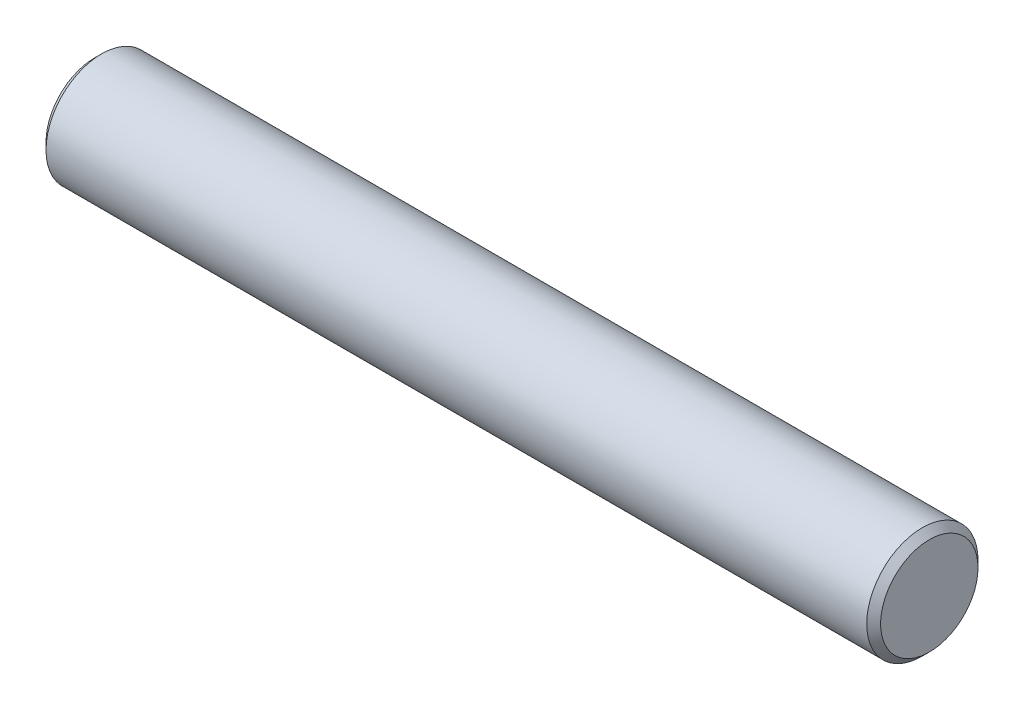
from build123d import *

# Parameters (mm, degrees)
ESQUISSE1_W     = 150
ESQUISSE1_H     = 10
CHANFREIN1_SIZE = 1.25


with BuildPart() as part:
    # Esquisse1 → R_volution1 (revolve)
    with BuildSketch(Plane.XY, mode=Mode.PRIVATE) as r_volution1_sk:
        with Locations((75, 5)):
            Rectangle(ESQUISSE1_W, ESQUISSE1_H)
    revolve(r_volution1_sk.sketch.rotate(Axis((0, 0, 0), (1, 0, 0)), 90), axis=Axis((0, 0, 0), (1, 0, 0)))

    # Chanfrein1
    chanfrein1_edges = [part.edges().sort_by_distance(p)[0] for p in [
        (150, 0, -10),
        (0, 0, -10),
    ]]
    chamfer(chanfrein1_edges, length=CHANFREIN1_SIZE)


solid = part.part
